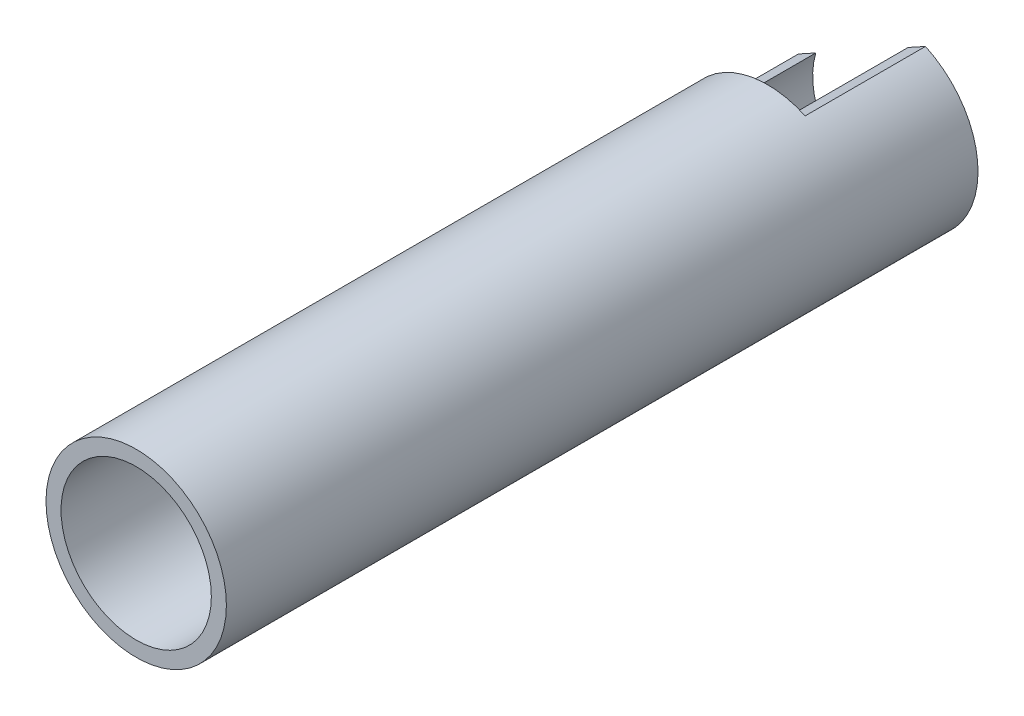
ISO-10303-21;
HEADER;
FILE_DESCRIPTION(('STEP AP214'),'2;1');
FILE_NAME('part.step','',(''),(''),'','','');
FILE_SCHEMA(('AUTOMOTIVE_DESIGN { 1 0 10303 214 1 1 1 1 }'));
ENDSEC;
DATA;
#1=APPLICATION_CONTEXT('core data for automotive mechanical design processes');
#2=APPLICATION_PROTOCOL_DEFINITION('international standard','automotive_design',2000,#1);
#3=PRODUCT_CONTEXT('',#1,'mechanical');
#4=PRODUCT('Part','Part','',(#3));
#5=PRODUCT_RELATED_PRODUCT_CATEGORY('part','',(#4));
#6=PRODUCT_DEFINITION_FORMATION('','',#4);
#7=PRODUCT_DEFINITION_CONTEXT('part definition',#1,'design');
#8=PRODUCT_DEFINITION('design','',#6,#7);
#9=PRODUCT_DEFINITION_SHAPE('','',#8);
#10=(LENGTH_UNIT() NAMED_UNIT(*) SI_UNIT(.MILLI.,.METRE.));
#11=(NAMED_UNIT(*) PLANE_ANGLE_UNIT() SI_UNIT($,.RADIAN.));
#12=(NAMED_UNIT(*) SI_UNIT($,.STERADIAN.) SOLID_ANGLE_UNIT());
#13=UNCERTAINTY_MEASURE_WITH_UNIT(LENGTH_MEASURE(1.E-05),#10,'distance_accuracy_value','');
#14=(GEOMETRIC_REPRESENTATION_CONTEXT(3) GLOBAL_UNCERTAINTY_ASSIGNED_CONTEXT((#13)) GLOBAL_UNIT_ASSIGNED_CONTEXT((#10,
#11,#12)) REPRESENTATION_CONTEXT('',''));
#15=CARTESIAN_POINT('',(0.,0.,0.));
#16=DIRECTION('',(0.,0.,1.));
#17=DIRECTION('',(1.,0.,0.));
#18=AXIS2_PLACEMENT_3D('',#15,#16,#17);
#19=CARTESIAN_POINT('',(1.66533453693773E-13,0.,0.));
#20=DIRECTION('',(0.,0.,1.));
#21=DIRECTION('',(1.,0.,0.));
#22=AXIS2_PLACEMENT_3D('',#19,#20,#21);
#23=PLANE('',#22);
#24=DIRECTION('',(-0.875681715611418,-0.482888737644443,0.));
#25=VECTOR('',#24,1.);
#26=CARTESIAN_POINT('',(-61.0035896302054,7.0818135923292,0.));
#27=LINE('',#26,#25);
#28=CARTESIAN_POINT('',(25.0352918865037,54.5273707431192,0.));
#29=VERTEX_POINT('',#28);
#30=CARTESIAN_POINT('',(13.4719843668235,48.1508633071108,0.));
#31=VERTEX_POINT('',#30);
#32=EDGE_CURVE('E79',#29,#31,#27,.T.);
#33=ORIENTED_EDGE('',*,*,#32,.F.);
#34=CARTESIAN_POINT('',(1.66533453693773E-13,0.,0.));
#35=DIRECTION('',(0.,0.,1.));
#36=DIRECTION('',(1.,0.,0.));
#37=AXIS2_PLACEMENT_3D('',#34,#35,#36);
#38=CIRCLE('',#37,60.0000000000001);
#39=CARTESIAN_POINT('',(-59.4742995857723,7.9251302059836,0.));
#40=VERTEX_POINT('',#39);
#41=EDGE_CURVE('E99',#40,#29,#38,.T.);
#42=ORIENTED_EDGE('',*,*,#41,.F.);
#43=CARTESIAN_POINT('',(-47.9109920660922,14.301637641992,0.));
#44=VERTEX_POINT('',#43);
#45=EDGE_CURVE('E55',#44,#40,#27,.T.);
#46=ORIENTED_EDGE('',*,*,#45,.F.);
#47=CARTESIAN_POINT('',(1.66533453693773E-13,0.,0.));
#48=DIRECTION('',(0.,0.,1.));
#49=DIRECTION('',(1.,0.,0.));
#50=AXIS2_PLACEMENT_3D('',#47,#48,#49);
#51=CIRCLE('',#50,50.);
#52=EDGE_CURVE('E91',#44,#31,#51,.T.);
#53=ORIENTED_EDGE('',*,*,#52,.T.);
#54=EDGE_LOOP('',(#33,#42,#46,#53));
#55=FACE_BOUND('',#54,.T.);
#56=ADVANCED_FACE('F35',(#55),#23,.F.);
#57=CARTESIAN_POINT('',(1.66533453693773E-13,0.,500.));
#58=DIRECTION('',(0.,0.,-1.));
#59=DIRECTION('',(-1.,0.,0.));
#60=AXIS2_PLACEMENT_3D('',#57,#58,#59);
#61=CYLINDRICAL_SURFACE('',#60,60.0000000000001);
#62=CARTESIAN_POINT('',(1.66533453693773E-13,0.,500.));
#63=DIRECTION('',(0.,0.,1.));
#64=DIRECTION('',(1.,0.,0.));
#65=AXIS2_PLACEMENT_3D('',#62,#63,#64);
#66=CIRCLE('',#65,60.0000000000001);
#67=CARTESIAN_POINT('',(60.0000000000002,0.,500.));
#68=VERTEX_POINT('',#67);
#69=EDGE_CURVE('E101',#68,#68,#66,.T.);
#70=ORIENTED_EDGE('',*,*,#69,.F.);
#71=EDGE_LOOP('',(#70));
#72=FACE_BOUND('',#71,.T.);
#73=DIRECTION('',(0.,0.,-1.));
#74=VECTOR('',#73,1.);
#75=CARTESIAN_POINT('',(25.0352918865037,54.5273707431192,500.));
#76=LINE('',#75,#74);
#77=CARTESIAN_POINT('',(25.0352918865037,54.5273707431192,80.));
#78=VERTEX_POINT('',#77);
#79=EDGE_CURVE('E78',#78,#29,#76,.T.);
#80=ORIENTED_EDGE('',*,*,#79,.F.);
#81=CARTESIAN_POINT('',(1.66533453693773E-13,0.,80.));
#82=DIRECTION('',(0.,0.,1.));
#83=DIRECTION('',(0.,-1.,0.));
#84=AXIS2_PLACEMENT_3D('',#81,#82,#83);
#85=CIRCLE('',#84,60.0000000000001);
#86=CARTESIAN_POINT('',(-59.4742995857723,7.92513020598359,80.));
#87=VERTEX_POINT('',#86);
#88=EDGE_CURVE('E84',#78,#87,#85,.T.);
#89=ORIENTED_EDGE('',*,*,#88,.T.);
#90=DIRECTION('',(0.,0.,-1.));
#91=VECTOR('',#90,1.);
#92=CARTESIAN_POINT('',(-59.4742995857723,7.92513020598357,500.));
#93=LINE('',#92,#91);
#94=EDGE_CURVE('E72',#40,#87,#93,.F.);
#95=ORIENTED_EDGE('',*,*,#94,.F.);
#96=ORIENTED_EDGE('',*,*,#41,.T.);
#97=EDGE_LOOP('',(#80,#89,#95,#96));
#98=FACE_BOUND('',#97,.T.);
#99=ADVANCED_FACE('F37',(#72,#98),#61,.T.);
#100=CARTESIAN_POINT('',(1.66533453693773E-13,0.,500.));
#101=DIRECTION('',(0.,0.,-1.));
#102=DIRECTION('',(-1.,0.,0.));
#103=AXIS2_PLACEMENT_3D('',#100,#101,#102);
#104=CYLINDRICAL_SURFACE('',#103,50.);
#105=CARTESIAN_POINT('',(1.66533453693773E-13,0.,500.));
#106=DIRECTION('',(0.,0.,1.));
#107=DIRECTION('',(1.,0.,0.));
#108=AXIS2_PLACEMENT_3D('',#105,#106,#107);
#109=CIRCLE('',#108,50.);
#110=CARTESIAN_POINT('',(50.0000000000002,0.,500.));
#111=VERTEX_POINT('',#110);
#112=EDGE_CURVE('E94',#111,#111,#109,.T.);
#113=ORIENTED_EDGE('',*,*,#112,.T.);
#114=EDGE_LOOP('',(#113));
#115=FACE_BOUND('',#114,.T.);
#116=CARTESIAN_POINT('',(1.66533453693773E-13,0.,80.));
#117=DIRECTION('',(0.,0.,1.));
#118=DIRECTION('',(0.,-1.,0.));
#119=AXIS2_PLACEMENT_3D('',#116,#117,#118);
#120=CIRCLE('',#119,50.);
#121=CARTESIAN_POINT('',(13.4719843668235,48.1508633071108,80.));
#122=VERTEX_POINT('',#121);
#123=CARTESIAN_POINT('',(-47.9109920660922,14.301637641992,80.));
#124=VERTEX_POINT('',#123);
#125=EDGE_CURVE('E43',#122,#124,#120,.T.);
#126=ORIENTED_EDGE('',*,*,#125,.F.);
#127=DIRECTION('',(0.,0.,-1.));
#128=VECTOR('',#127,1.);
#129=CARTESIAN_POINT('',(13.4719843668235,48.1508633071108,500.));
#130=LINE('',#129,#128);
#131=EDGE_CURVE('E11',#122,#31,#130,.T.);
#132=ORIENTED_EDGE('',*,*,#131,.T.);
#133=ORIENTED_EDGE('',*,*,#52,.F.);
#134=DIRECTION('',(0.,0.,-1.));
#135=VECTOR('',#134,1.);
#136=CARTESIAN_POINT('',(-47.9109920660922,14.301637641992,500.));
#137=LINE('',#136,#135);
#138=EDGE_CURVE('E104',#44,#124,#137,.F.);
#139=ORIENTED_EDGE('',*,*,#138,.T.);
#140=EDGE_LOOP('',(#126,#132,#133,#139));
#141=FACE_BOUND('',#140,.T.);
#142=ADVANCED_FACE('F108',(#115,#141),#104,.F.);
#143=CARTESIAN_POINT('',(1.66533453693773E-13,0.,500.));
#144=DIRECTION('',(0.,0.,1.));
#145=DIRECTION('',(1.,0.,0.));
#146=AXIS2_PLACEMENT_3D('',#143,#144,#145);
#147=PLANE('',#146);
#148=ORIENTED_EDGE('',*,*,#69,.T.);
#149=EDGE_LOOP('',(#148));
#150=FACE_BOUND('',#149,.T.);
#151=ORIENTED_EDGE('',*,*,#112,.F.);
#152=EDGE_LOOP('',(#151));
#153=FACE_BOUND('',#152,.T.);
#154=ADVANCED_FACE('F120',(#150,#153),#147,.T.);
#155=CARTESIAN_POINT('',(-61.0035896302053,7.0818135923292,80.));
#156=DIRECTION('',(0.,0.,1.));
#157=DIRECTION('',(0.,-1.,0.));
#158=AXIS2_PLACEMENT_3D('',#155,#156,#157);
#159=PLANE('',#158);
#160=DIRECTION('',(0.875681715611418,0.482888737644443,0.));
#161=VECTOR('',#160,1.);
#162=CARTESIAN_POINT('',(-61.0035896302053,7.0818135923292,80.));
#163=LINE('',#162,#161);
#164=EDGE_CURVE('E88',#122,#78,#163,.T.);
#165=ORIENTED_EDGE('',*,*,#164,.F.);
#166=ORIENTED_EDGE('',*,*,#125,.T.);
#167=EDGE_CURVE('E50',#87,#124,#163,.T.);
#168=ORIENTED_EDGE('',*,*,#167,.F.);
#169=ORIENTED_EDGE('',*,*,#88,.F.);
#170=EDGE_LOOP('',(#165,#166,#168,#169));
#171=FACE_BOUND('',#170,.T.);
#172=ADVANCED_FACE('F83',(#171),#159,.F.);
#173=CARTESIAN_POINT('',(-17.2195038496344,31.2262504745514,0.));
#174=DIRECTION('',(-0.482888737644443,0.875681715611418,0.));
#175=DIRECTION('',(-0.875681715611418,-0.482888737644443,0.));
#176=AXIS2_PLACEMENT_3D('',#173,#174,#175);
#177=PLANE('',#176);
#178=ORIENTED_EDGE('',*,*,#79,.T.);
#179=ORIENTED_EDGE('',*,*,#32,.T.);
#180=ORIENTED_EDGE('',*,*,#131,.F.);
#181=ORIENTED_EDGE('',*,*,#164,.T.);
#182=EDGE_LOOP('',(#178,#179,#180,#181));
#183=FACE_BOUND('',#182,.T.);
#184=ADVANCED_FACE('F113',(#183),#177,.T.);
#185=ORIENTED_EDGE('',*,*,#94,.T.);
#186=ORIENTED_EDGE('',*,*,#167,.T.);
#187=ORIENTED_EDGE('',*,*,#138,.F.);
#188=ORIENTED_EDGE('',*,*,#45,.T.);
#189=EDGE_LOOP('',(#185,#186,#187,#188));
#190=FACE_BOUND('',#189,.T.);
#191=ADVANCED_FACE('F73',(#190),#177,.T.);
#192=CLOSED_SHELL('',(#56,#99,#142,#154,#172,#184,#191));
#193=MANIFOLD_SOLID_BREP('B2',#192);
#194=ADVANCED_BREP_SHAPE_REPRESENTATION('',(#18,#193),#14);
#195=SHAPE_DEFINITION_REPRESENTATION(#9,#194);
ENDSEC;
END-ISO-10303-21;
